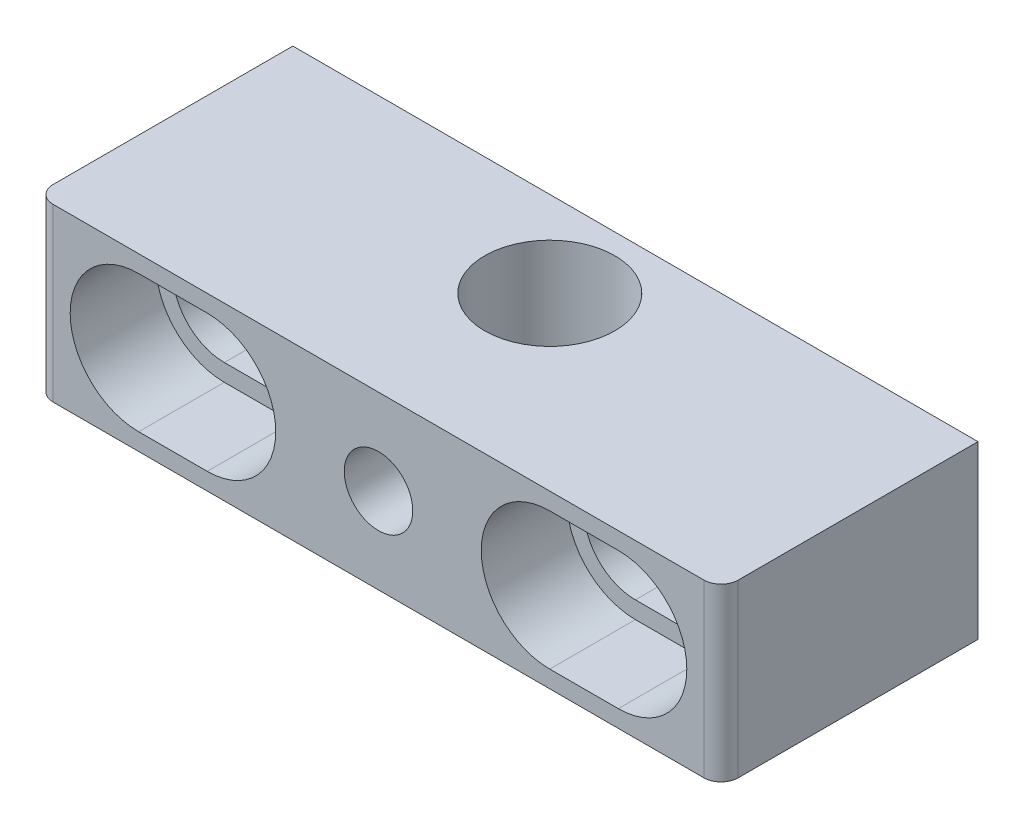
from build123d import *

# Parameters (mm, degrees)
SKETCH1_W           = 50.8
SKETCH1_H           = 12.7
BOSS_EXTRUDE1_DEPTH = 6.35
SKETCH2_W           = 50.8
SKETCH2_H           = 12.7
BOSS_EXTRUDE2_DEPTH = 12.7
FILLET1_R           = 1.27
SKETCH3_R           = 4.826
CUT_EXTRUDE1_DEPTH  = 12.7
SKETCH4_R           = 2.54
CUT_EXTRUDE2_DEPTH  = 12.7


with BuildPart() as part:
    # Sketch1 → Boss-Extrude1 (new body)
    with BuildSketch(Plane.XY):
        Rectangle(SKETCH1_W, SKETCH1_H)
        with BuildLine():
            Line((-17.78, 5.08), (-12.7, 5.08))
            ThreePointArc((-12.7, 5.08), (-7.62, 0), (-12.7, -5.08))
            Line((-12.7, -5.08), (-17.78, -5.08))
            ThreePointArc((-17.78, -5.08), (-22.86, 0), (-17.78, 5.08))
        make_face(mode=Mode.SUBTRACT)
        with BuildLine():
            Line((17.78, 5.08), (12.7, 5.08))
            ThreePointArc((12.7, 5.08), (7.62, 0), (12.7, -5.08))
            Line((12.7, -5.08), (17.78, -5.08))
            ThreePointArc((17.78, -5.08), (22.86, 0), (17.78, 5.08))
        make_face(mode=Mode.SUBTRACT)
    extrude(amount=BOSS_EXTRUDE1_DEPTH)

    # Sketch2 → Boss-Extrude2 (add)
    with BuildSketch(Plane(origin=(0, 0, 0), x_dir=(-1, 0, 0), z_dir=(0, 0, -1))):
        Rectangle(SKETCH2_W, SKETCH2_H)
        with BuildLine():
            Line((-17.78, 3.81), (-12.7, 3.81))
            ThreePointArc((-12.7, 3.81), (-8.89, 0), (-12.7, -3.81))
            Line((-12.7, -3.81), (-17.78, -3.81))
            ThreePointArc((-17.78, -3.81), (-21.59, 0), (-17.78, 3.81))
        make_face(mode=Mode.SUBTRACT)
        with BuildLine():
            Line((17.78, 3.81), (12.7, 3.81))
            ThreePointArc((12.7, 3.81), (8.89, 0), (12.7, -3.81))
            Line((12.7, -3.81), (17.78, -3.81))
            ThreePointArc((17.78, -3.81), (21.59, 0), (17.78, 3.81))
        make_face(mode=Mode.SUBTRACT)
    extrude(amount=BOSS_EXTRUDE2_DEPTH)

    # Fillet1
    fillet1_edges = [part.edges().sort_by_distance(p)[0] for p in [
        (-25.4, 0, 6.35),
        (25.4, 0, 6.35),
    ]]
    fillet(fillet1_edges, radius=FILLET1_R)

    # Sketch3 → Cut-Extrude1 (cut)
    with BuildSketch(Plane(origin=(0, 6.35, 0), x_dir=(1, 0, 0), z_dir=(0, 1, 0))):
        with Locations(Location((0, 6.35, 0), (0, 0, 270))):
            Circle(SKETCH3_R)
    extrude(amount=-CUT_EXTRUDE1_DEPTH, mode=Mode.SUBTRACT)

    # Sketch4 → Cut-Extrude2 (cut)
    with BuildSketch(Plane.XY.offset(6.35)):
        Circle(SKETCH4_R)
    extrude(amount=-CUT_EXTRUDE2_DEPTH, mode=Mode.SUBTRACT)


solid = part.part
